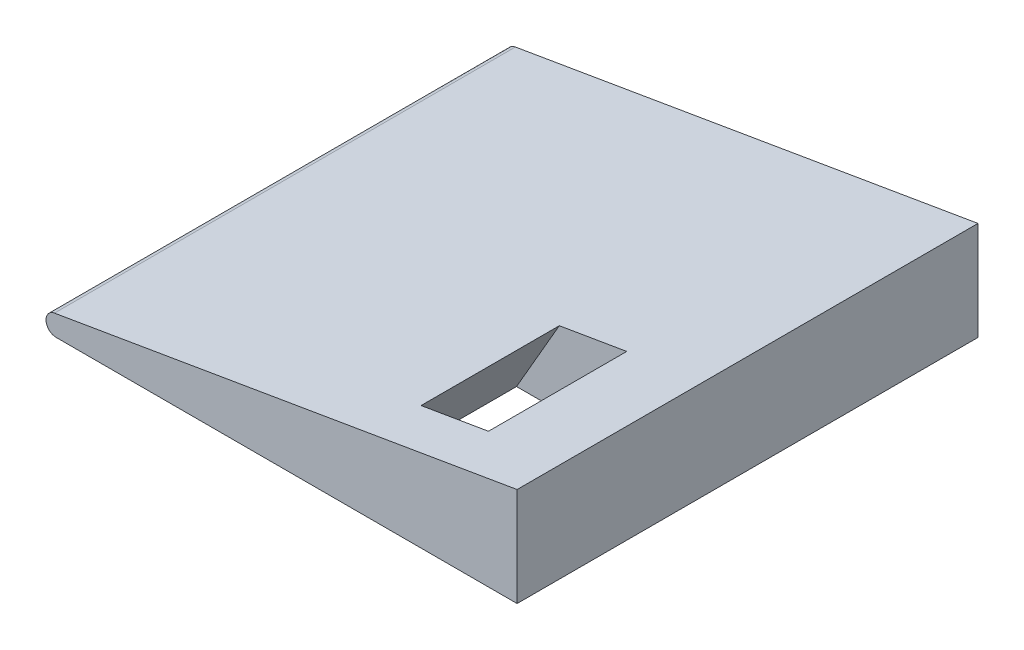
from build123d import *

# Parameters (mm, degrees)
BASE_EXTRUDE_DEPTH = 177.8
SKETCH3_W          = 40.64
SKETCH3_H          = 106.68
CUT_EXTRUDE4_DEPTH = 463.130566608


with BuildPart() as part:
    # Sketch1 → Base-Extrude (new, symmetric)
    with BuildSketch(Plane.XY):
        with BuildLine():
            Line((0, 0), (-355.6, 0))
            ThreePointArc((-355.6, 0), (-363.434135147, 7.201697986), (-356.915749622, 15.612927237))
            Line((-356.915749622, 15.612927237), (0, 76.2))
            Line((0, 76.2), (0, 0))
        make_face()
    extrude(amount=BASE_EXTRUDE_DEPTH, both=True)

    # Sketch3 → Cut-Extrude4 (cut, through all)
    with BuildSketch(Plane(origin=(53.073229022, 91.925529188, 0), x_dir=(-0.8660254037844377, 0.5000000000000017, 0), z_dir=(0.5000000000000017, 0.8660254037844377, 0))):
        with Locations((105.428328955, 86.36)):
            Rectangle(SKETCH3_W, SKETCH3_H)
    extrude(amount=-CUT_EXTRUDE4_DEPTH, mode=Mode.SUBTRACT)


solid = part.part
